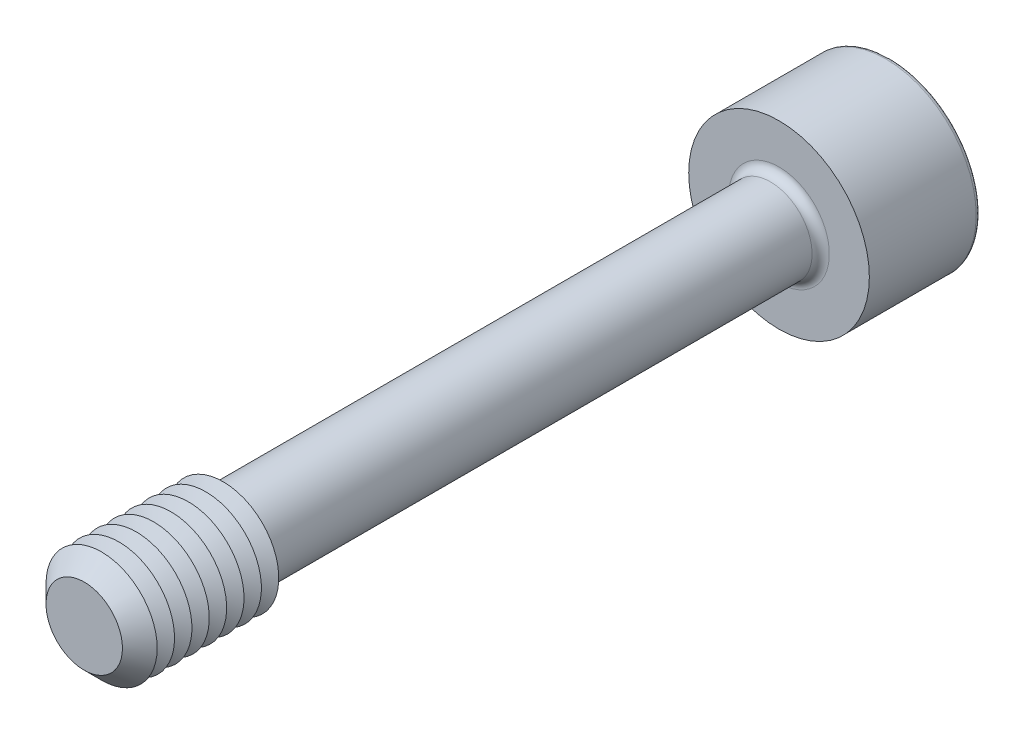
ISO-10303-21;
HEADER;
FILE_DESCRIPTION(('STEP AP214'),'2;1');
FILE_NAME('part.step','',(''),(''),'','','');
FILE_SCHEMA(('AUTOMOTIVE_DESIGN { 1 0 10303 214 1 1 1 1 }'));
ENDSEC;
DATA;
#1=APPLICATION_CONTEXT('core data for automotive mechanical design processes');
#2=APPLICATION_PROTOCOL_DEFINITION('international standard','automotive_design',2000,#1);
#3=PRODUCT_CONTEXT('',#1,'mechanical');
#4=PRODUCT('Part','Part','',(#3));
#5=PRODUCT_RELATED_PRODUCT_CATEGORY('part','',(#4));
#6=PRODUCT_DEFINITION_FORMATION('','',#4);
#7=PRODUCT_DEFINITION_CONTEXT('part definition',#1,'design');
#8=PRODUCT_DEFINITION('design','',#6,#7);
#9=PRODUCT_DEFINITION_SHAPE('','',#8);
#10=(LENGTH_UNIT() NAMED_UNIT(*) SI_UNIT(.MILLI.,.METRE.));
#11=(NAMED_UNIT(*) PLANE_ANGLE_UNIT() SI_UNIT($,.RADIAN.));
#12=(NAMED_UNIT(*) SI_UNIT($,.STERADIAN.) SOLID_ANGLE_UNIT());
#13=UNCERTAINTY_MEASURE_WITH_UNIT(LENGTH_MEASURE(1.E-05),#10,'distance_accuracy_value','');
#14=(GEOMETRIC_REPRESENTATION_CONTEXT(3) GLOBAL_UNCERTAINTY_ASSIGNED_CONTEXT((#13)) GLOBAL_UNIT_ASSIGNED_CONTEXT((#10,
#11,#12)) REPRESENTATION_CONTEXT('',''));
#15=CARTESIAN_POINT('',(0.,0.,0.));
#16=DIRECTION('',(0.,0.,1.));
#17=DIRECTION('',(1.,0.,0.));
#18=AXIS2_PLACEMENT_3D('',#15,#16,#17);
#19=CARTESIAN_POINT('',(-1.73205080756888,-3.,-27.));
#20=DIRECTION('',(0.,0.,1.));
#21=DIRECTION('',(1.,0.,0.));
#22=AXIS2_PLACEMENT_3D('',#19,#20,#21);
#23=PLANE('',#22);
#24=DIRECTION('',(1.,0.,0.));
#25=VECTOR('',#24,1.);
#26=CARTESIAN_POINT('',(-1.73205080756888,-3.,-27.));
#27=LINE('',#26,#25);
#28=CARTESIAN_POINT('',(0.,-3.,-27.));
#29=VERTEX_POINT('',#28);
#30=CARTESIAN_POINT('',(1.73205080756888,-3.,-27.));
#31=VERTEX_POINT('',#30);
#32=EDGE_CURVE('E404',#29,#31,#27,.T.);
#33=ORIENTED_EDGE('',*,*,#32,.F.);
#34=CARTESIAN_POINT('',(0.,0.,-27.));
#35=DIRECTION('',(0.,0.,1.));
#36=DIRECTION('',(0.,-1.,0.));
#37=AXIS2_PLACEMENT_3D('',#34,#35,#36);
#38=CIRCLE('',#37,3.);
#39=CARTESIAN_POINT('',(2.59807621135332,-1.5,-27.));
#40=VERTEX_POINT('',#39);
#41=EDGE_CURVE('E53',#29,#40,#38,.T.);
#42=ORIENTED_EDGE('',*,*,#41,.T.);
#43=DIRECTION('',(0.5,0.866025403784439,0.));
#44=VECTOR('',#43,1.);
#45=CARTESIAN_POINT('',(1.73205080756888,-3.,-27.));
#46=LINE('',#45,#44);
#47=EDGE_CURVE('E392',#31,#40,#46,.T.);
#48=ORIENTED_EDGE('',*,*,#47,.F.);
#49=EDGE_LOOP('',(#33,#42,#48));
#50=FACE_BOUND('',#49,.T.);
#51=ADVANCED_FACE('F41',(#50),#23,.F.);
#52=CARTESIAN_POINT('',(3.46410161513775,0.,-27.));
#53=VERTEX_POINT('',#52);
#54=EDGE_CURVE('E398',#40,#53,#46,.T.);
#55=ORIENTED_EDGE('',*,*,#54,.F.);
#56=CARTESIAN_POINT('',(2.59807621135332,1.5,-27.));
#57=VERTEX_POINT('',#56);
#58=EDGE_CURVE('E11',#40,#57,#38,.T.);
#59=ORIENTED_EDGE('',*,*,#58,.T.);
#60=DIRECTION('',(-0.5,0.866025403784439,0.));
#61=VECTOR('',#60,1.);
#62=CARTESIAN_POINT('',(3.46410161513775,0.,-27.));
#63=LINE('',#62,#61);
#64=EDGE_CURVE('E388',#53,#57,#63,.T.);
#65=ORIENTED_EDGE('',*,*,#64,.F.);
#66=EDGE_LOOP('',(#55,#59,#65));
#67=FACE_BOUND('',#66,.T.);
#68=ADVANCED_FACE('F133',(#67),#23,.F.);
#69=CARTESIAN_POINT('',(1.73205080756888,3.,-27.));
#70=VERTEX_POINT('',#69);
#71=EDGE_CURVE('E387',#57,#70,#63,.T.);
#72=ORIENTED_EDGE('',*,*,#71,.F.);
#73=CARTESIAN_POINT('',(0.,3.,-27.));
#74=VERTEX_POINT('',#73);
#75=EDGE_CURVE('E51',#57,#74,#38,.T.);
#76=ORIENTED_EDGE('',*,*,#75,.T.);
#77=DIRECTION('',(-1.,0.,0.));
#78=VECTOR('',#77,1.);
#79=CARTESIAN_POINT('',(1.73205080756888,3.,-27.));
#80=LINE('',#79,#78);
#81=EDGE_CURVE('E177',#70,#74,#80,.T.);
#82=ORIENTED_EDGE('',*,*,#81,.F.);
#83=EDGE_LOOP('',(#72,#76,#82));
#84=FACE_BOUND('',#83,.T.);
#85=ADVANCED_FACE('F139',(#84),#23,.F.);
#86=CARTESIAN_POINT('',(-1.73205080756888,3.,-27.));
#87=VERTEX_POINT('',#86);
#88=EDGE_CURVE('E395',#74,#87,#80,.T.);
#89=ORIENTED_EDGE('',*,*,#88,.F.);
#90=CARTESIAN_POINT('',(-2.59807621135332,1.5,-27.));
#91=VERTEX_POINT('',#90);
#92=EDGE_CURVE('E264',#74,#91,#38,.T.);
#93=ORIENTED_EDGE('',*,*,#92,.T.);
#94=DIRECTION('',(-0.5,-0.866025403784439,0.));
#95=VECTOR('',#94,1.);
#96=CARTESIAN_POINT('',(-1.73205080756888,3.,-27.));
#97=LINE('',#96,#95);
#98=EDGE_CURVE('E176',#87,#91,#97,.T.);
#99=ORIENTED_EDGE('',*,*,#98,.F.);
#100=EDGE_LOOP('',(#89,#93,#99));
#101=FACE_BOUND('',#100,.T.);
#102=ADVANCED_FACE('F157',(#101),#23,.F.);
#103=CARTESIAN_POINT('',(-3.46410161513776,0.,-27.));
#104=VERTEX_POINT('',#103);
#105=EDGE_CURVE('E170',#91,#104,#97,.T.);
#106=ORIENTED_EDGE('',*,*,#105,.F.);
#107=CARTESIAN_POINT('',(-2.59807621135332,-1.5,-27.));
#108=VERTEX_POINT('',#107);
#109=EDGE_CURVE('E172',#91,#108,#38,.T.);
#110=ORIENTED_EDGE('',*,*,#109,.T.);
#111=DIRECTION('',(0.5,-0.866025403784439,0.));
#112=VECTOR('',#111,1.);
#113=CARTESIAN_POINT('',(-3.46410161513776,0.,-27.));
#114=LINE('',#113,#112);
#115=EDGE_CURVE('E174',#104,#108,#114,.T.);
#116=ORIENTED_EDGE('',*,*,#115,.F.);
#117=EDGE_LOOP('',(#106,#110,#116));
#118=FACE_BOUND('',#117,.T.);
#119=ADVANCED_FACE('F146',(#118),#23,.F.);
#120=CARTESIAN_POINT('',(0.,0.,-33.));
#121=DIRECTION('',(0.,0.,-1.));
#122=DIRECTION('',(-1.,0.,0.));
#123=AXIS2_PLACEMENT_3D('',#120,#121,#122);
#124=PLANE('',#123);
#125=CARTESIAN_POINT('',(0.,0.,-33.));
#126=DIRECTION('',(0.,0.,-1.));
#127=DIRECTION('',(-1.,0.,0.));
#128=AXIS2_PLACEMENT_3D('',#125,#126,#127);
#129=CIRCLE('',#128,6.19);
#130=CARTESIAN_POINT('',(-6.19,0.,-33.));
#131=VERTEX_POINT('',#130);
#132=EDGE_CURVE('E248',#131,#131,#129,.T.);
#133=ORIENTED_EDGE('',*,*,#132,.T.);
#134=EDGE_LOOP('',(#133));
#135=FACE_BOUND('',#134,.T.);
#136=DIRECTION('',(-0.5,-0.866025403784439,0.));
#137=VECTOR('',#136,1.);
#138=CARTESIAN_POINT('',(-1.73205080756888,3.,-33.));
#139=LINE('',#138,#137);
#140=CARTESIAN_POINT('',(-1.73205080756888,3.,-33.));
#141=VERTEX_POINT('',#140);
#142=CARTESIAN_POINT('',(-3.46410161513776,0.,-33.));
#143=VERTEX_POINT('',#142);
#144=EDGE_CURVE('E211',#141,#143,#139,.T.);
#145=ORIENTED_EDGE('',*,*,#144,.T.);
#146=DIRECTION('',(0.5,-0.866025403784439,0.));
#147=VECTOR('',#146,1.);
#148=CARTESIAN_POINT('',(-3.46410161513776,0.,-33.));
#149=LINE('',#148,#147);
#150=CARTESIAN_POINT('',(-1.73205080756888,-3.,-33.));
#151=VERTEX_POINT('',#150);
#152=EDGE_CURVE('E67',#143,#151,#149,.T.);
#153=ORIENTED_EDGE('',*,*,#152,.T.);
#154=DIRECTION('',(1.,0.,0.));
#155=VECTOR('',#154,1.);
#156=CARTESIAN_POINT('',(-1.73205080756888,-3.,-33.));
#157=LINE('',#156,#155);
#158=CARTESIAN_POINT('',(1.73205080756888,-3.,-33.));
#159=VERTEX_POINT('',#158);
#160=EDGE_CURVE('E195',#151,#159,#157,.T.);
#161=ORIENTED_EDGE('',*,*,#160,.T.);
#162=DIRECTION('',(0.5,0.866025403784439,0.));
#163=VECTOR('',#162,1.);
#164=CARTESIAN_POINT('',(1.73205080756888,-3.,-33.));
#165=LINE('',#164,#163);
#166=CARTESIAN_POINT('',(3.46410161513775,0.,-33.));
#167=VERTEX_POINT('',#166);
#168=EDGE_CURVE('E199',#159,#167,#165,.T.);
#169=ORIENTED_EDGE('',*,*,#168,.T.);
#170=DIRECTION('',(-0.5,0.866025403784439,0.));
#171=VECTOR('',#170,1.);
#172=CARTESIAN_POINT('',(3.46410161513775,0.,-33.));
#173=LINE('',#172,#171);
#174=CARTESIAN_POINT('',(1.73205080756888,3.,-33.));
#175=VERTEX_POINT('',#174);
#176=EDGE_CURVE('E203',#167,#175,#173,.T.);
#177=ORIENTED_EDGE('',*,*,#176,.T.);
#178=DIRECTION('',(-1.,0.,0.));
#179=VECTOR('',#178,1.);
#180=CARTESIAN_POINT('',(1.73205080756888,3.,-33.));
#181=LINE('',#180,#179);
#182=EDGE_CURVE('E207',#175,#141,#181,.T.);
#183=ORIENTED_EDGE('',*,*,#182,.T.);
#184=EDGE_LOOP('',(#145,#153,#161,#169,#177,#183));
#185=FACE_BOUND('',#184,.T.);
#186=ADVANCED_FACE('F156',(#135,#185),#124,.T.);
#187=CARTESIAN_POINT('',(0.,0.,25.));
#188=DIRECTION('',(0.,0.,-1.));
#189=DIRECTION('',(-1.,0.,0.));
#190=AXIS2_PLACEMENT_3D('',#187,#188,#189);
#191=CYLINDRICAL_SURFACE('',#190,3.);
#192=CARTESIAN_POINT('',(0.,0.,-24.38));
#193=DIRECTION('',(0.,0.,-1.));
#194=DIRECTION('',(-1.,0.,0.));
#195=AXIS2_PLACEMENT_3D('',#192,#193,#194);
#196=CIRCLE('',#195,3.);
#197=CARTESIAN_POINT('',(-3.,0.,-24.38));
#198=VERTEX_POINT('',#197);
#199=EDGE_CURVE('E245',#198,#198,#196,.F.);
#200=ORIENTED_EDGE('',*,*,#199,.T.);
#201=EDGE_LOOP('',(#200));
#202=FACE_BOUND('',#201,.T.);
#203=CARTESIAN_POINT('',(0.,0.,14.4226497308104));
#204=DIRECTION('',(0.,0.,-1.));
#205=DIRECTION('',(0.,1.,0.));
#206=AXIS2_PLACEMENT_3D('',#203,#204,#205);
#207=CIRCLE('',#206,3.);
#208=CARTESIAN_POINT('',(0.,3.,14.4226497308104));
#209=VERTEX_POINT('',#208);
#210=EDGE_CURVE('E234',#209,#209,#207,.T.);
#211=ORIENTED_EDGE('',*,*,#210,.T.);
#212=EDGE_LOOP('',(#211));
#213=FACE_BOUND('',#212,.T.);
#214=ADVANCED_FACE('F163',(#202,#213),#191,.T.);
#215=CARTESIAN_POINT('',(0.,0.,14.4226497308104));
#216=DIRECTION('',(0.,0.,1.));
#217=DIRECTION('',(0.,-1.,0.));
#218=AXIS2_PLACEMENT_3D('',#215,#216,#217);
#219=CONICAL_SURFACE('',#218,3.,1.0471975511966);
#220=CARTESIAN_POINT('',(0.,0.,15.));
#221=DIRECTION('',(0.,0.,-1.));
#222=DIRECTION('',(-1.,0.,0.));
#223=AXIS2_PLACEMENT_3D('',#220,#221,#222);
#224=CIRCLE('',#223,4.);
#225=CARTESIAN_POINT('',(-4.,0.,15.));
#226=VERTEX_POINT('',#225);
#227=EDGE_CURVE('E268',#226,#226,#224,.T.);
#228=ORIENTED_EDGE('',*,*,#227,.T.);
#229=EDGE_LOOP('',(#228));
#230=FACE_BOUND('',#229,.T.);
#231=ORIENTED_EDGE('',*,*,#210,.F.);
#232=EDGE_LOOP('',(#231));
#233=FACE_BOUND('',#232,.T.);
#234=ADVANCED_FACE('F345',(#230,#233),#219,.T.);
#235=CARTESIAN_POINT('',(0.,0.,-25.));
#236=DIRECTION('',(0.,0.,-1.));
#237=DIRECTION('',(-1.,0.,0.));
#238=AXIS2_PLACEMENT_3D('',#235,#236,#237);
#239=PLANE('',#238);
#240=CARTESIAN_POINT('',(0.,0.,-25.));
#241=DIRECTION('',(0.,0.,-1.));
#242=DIRECTION('',(-1.,0.,0.));
#243=AXIS2_PLACEMENT_3D('',#240,#241,#242);
#244=CIRCLE('',#243,3.62);
#245=CARTESIAN_POINT('',(-3.62,0.,-25.));
#246=VERTEX_POINT('',#245);
#247=EDGE_CURVE('E241',#246,#246,#244,.T.);
#248=ORIENTED_EDGE('',*,*,#247,.T.);
#249=EDGE_LOOP('',(#248));
#250=FACE_BOUND('',#249,.T.);
#251=CARTESIAN_POINT('',(0.,0.,-25.));
#252=DIRECTION('',(0.,0.,-1.));
#253=DIRECTION('',(-1.,0.,0.));
#254=AXIS2_PLACEMENT_3D('',#251,#252,#253);
#255=CIRCLE('',#254,6.5);
#256=CARTESIAN_POINT('',(-6.5,0.,-25.));
#257=VERTEX_POINT('',#256);
#258=EDGE_CURVE('E230',#257,#257,#255,.T.);
#259=ORIENTED_EDGE('',*,*,#258,.F.);
#260=EDGE_LOOP('',(#259));
#261=FACE_BOUND('',#260,.T.);
#262=ADVANCED_FACE('F350',(#250,#261),#239,.F.);
#263=CARTESIAN_POINT('',(0.,0.,-33.));
#264=DIRECTION('',(0.,0.,1.));
#265=DIRECTION('',(1.,0.,0.));
#266=AXIS2_PLACEMENT_3D('',#263,#264,#265);
#267=CYLINDRICAL_SURFACE('',#266,6.5);
#268=CARTESIAN_POINT('',(0.,0.,-32.69));
#269=DIRECTION('',(0.,0.,-1.));
#270=DIRECTION('',(-1.,0.,0.));
#271=AXIS2_PLACEMENT_3D('',#268,#269,#270);
#272=CIRCLE('',#271,6.5);
#273=CARTESIAN_POINT('',(-6.5,0.,-32.69));
#274=VERTEX_POINT('',#273);
#275=EDGE_CURVE('E45',#274,#274,#272,.F.);
#276=ORIENTED_EDGE('',*,*,#275,.T.);
#277=EDGE_LOOP('',(#276));
#278=FACE_BOUND('',#277,.T.);
#279=ORIENTED_EDGE('',*,*,#258,.T.);
#280=EDGE_LOOP('',(#279));
#281=FACE_BOUND('',#280,.T.);
#282=ADVANCED_FACE('F351',(#278,#281),#267,.T.);
#283=CARTESIAN_POINT('',(-3.46410161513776,0.,-27.));
#284=DIRECTION('',(0.866025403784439,0.5,0.));
#285=DIRECTION('',(-0.5,0.866025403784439,0.));
#286=AXIS2_PLACEMENT_3D('',#283,#284,#285);
#287=PLANE('',#286);
#288=ORIENTED_EDGE('',*,*,#152,.F.);
#289=DIRECTION('',(0.,0.,-1.));
#290=VECTOR('',#289,1.);
#291=CARTESIAN_POINT('',(-3.46410161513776,0.,-27.));
#292=LINE('',#291,#290);
#293=EDGE_CURVE('E186',#104,#143,#292,.T.);
#294=ORIENTED_EDGE('',*,*,#293,.F.);
#295=ORIENTED_EDGE('',*,*,#115,.T.);
#296=CARTESIAN_POINT('',(-1.73205080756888,-3.,-27.));
#297=VERTEX_POINT('',#296);
#298=EDGE_CURVE('E214',#108,#297,#114,.T.);
#299=ORIENTED_EDGE('',*,*,#298,.T.);
#300=DIRECTION('',(0.,0.,-1.));
#301=VECTOR('',#300,1.);
#302=CARTESIAN_POINT('',(-1.73205080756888,-3.,-27.));
#303=LINE('',#302,#301);
#304=EDGE_CURVE('E227',#297,#151,#303,.T.);
#305=ORIENTED_EDGE('',*,*,#304,.T.);
#306=EDGE_LOOP('',(#288,#294,#295,#299,#305));
#307=FACE_BOUND('',#306,.T.);
#308=ADVANCED_FACE('F354',(#307),#287,.T.);
#309=CARTESIAN_POINT('',(-1.73205080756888,-3.,-27.));
#310=DIRECTION('',(0.,1.,0.));
#311=DIRECTION('',(0.,0.,1.));
#312=AXIS2_PLACEMENT_3D('',#309,#310,#311);
#313=PLANE('',#312);
#314=ORIENTED_EDGE('',*,*,#160,.F.);
#315=ORIENTED_EDGE('',*,*,#304,.F.);
#316=EDGE_CURVE('E401',#297,#29,#27,.T.);
#317=ORIENTED_EDGE('',*,*,#316,.T.);
#318=ORIENTED_EDGE('',*,*,#32,.T.);
#319=DIRECTION('',(0.,0.,-1.));
#320=VECTOR('',#319,1.);
#321=CARTESIAN_POINT('',(1.73205080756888,-3.,-27.));
#322=LINE('',#321,#320);
#323=EDGE_CURVE('E224',#31,#159,#322,.T.);
#324=ORIENTED_EDGE('',*,*,#323,.T.);
#325=EDGE_LOOP('',(#314,#315,#317,#318,#324));
#326=FACE_BOUND('',#325,.T.);
#327=ADVANCED_FACE('F360',(#326),#313,.T.);
#328=CARTESIAN_POINT('',(1.73205080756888,-3.,-27.));
#329=DIRECTION('',(-0.866025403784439,0.5,0.));
#330=DIRECTION('',(-0.5,-0.866025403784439,0.));
#331=AXIS2_PLACEMENT_3D('',#328,#329,#330);
#332=PLANE('',#331);
#333=ORIENTED_EDGE('',*,*,#168,.F.);
#334=ORIENTED_EDGE('',*,*,#323,.F.);
#335=ORIENTED_EDGE('',*,*,#47,.T.);
#336=ORIENTED_EDGE('',*,*,#54,.T.);
#337=DIRECTION('',(0.,0.,-1.));
#338=VECTOR('',#337,1.);
#339=CARTESIAN_POINT('',(3.46410161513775,0.,-27.));
#340=LINE('',#339,#338);
#341=EDGE_CURVE('E221',#53,#167,#340,.T.);
#342=ORIENTED_EDGE('',*,*,#341,.T.);
#343=EDGE_LOOP('',(#333,#334,#335,#336,#342));
#344=FACE_BOUND('',#343,.T.);
#345=ADVANCED_FACE('F363',(#344),#332,.T.);
#346=CARTESIAN_POINT('',(3.46410161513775,0.,-27.));
#347=DIRECTION('',(-0.866025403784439,-0.5,0.));
#348=DIRECTION('',(0.5,-0.866025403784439,0.));
#349=AXIS2_PLACEMENT_3D('',#346,#347,#348);
#350=PLANE('',#349);
#351=ORIENTED_EDGE('',*,*,#176,.F.);
#352=ORIENTED_EDGE('',*,*,#341,.F.);
#353=ORIENTED_EDGE('',*,*,#64,.T.);
#354=ORIENTED_EDGE('',*,*,#71,.T.);
#355=DIRECTION('',(0.,0.,-1.));
#356=VECTOR('',#355,1.);
#357=CARTESIAN_POINT('',(1.73205080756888,3.,-27.));
#358=LINE('',#357,#356);
#359=EDGE_CURVE('E218',#70,#175,#358,.T.);
#360=ORIENTED_EDGE('',*,*,#359,.T.);
#361=EDGE_LOOP('',(#351,#352,#353,#354,#360));
#362=FACE_BOUND('',#361,.T.);
#363=ADVANCED_FACE('F367',(#362),#350,.T.);
#364=CARTESIAN_POINT('',(1.73205080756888,3.,-27.));
#365=DIRECTION('',(0.,-1.,0.));
#366=DIRECTION('',(1.,0.,0.));
#367=AXIS2_PLACEMENT_3D('',#364,#365,#366);
#368=PLANE('',#367);
#369=ORIENTED_EDGE('',*,*,#182,.F.);
#370=ORIENTED_EDGE('',*,*,#359,.F.);
#371=ORIENTED_EDGE('',*,*,#81,.T.);
#372=ORIENTED_EDGE('',*,*,#88,.T.);
#373=DIRECTION('',(0.,0.,-1.));
#374=VECTOR('',#373,1.);
#375=CARTESIAN_POINT('',(-1.73205080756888,3.,-27.));
#376=LINE('',#375,#374);
#377=EDGE_CURVE('E182',#87,#141,#376,.T.);
#378=ORIENTED_EDGE('',*,*,#377,.T.);
#379=EDGE_LOOP('',(#369,#370,#371,#372,#378));
#380=FACE_BOUND('',#379,.T.);
#381=ADVANCED_FACE('F152',(#380),#368,.T.);
#382=CARTESIAN_POINT('',(-1.73205080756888,3.,-27.));
#383=DIRECTION('',(0.866025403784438,-0.5,0.));
#384=DIRECTION('',(0.5,0.866025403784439,0.));
#385=AXIS2_PLACEMENT_3D('',#382,#383,#384);
#386=PLANE('',#385);
#387=ORIENTED_EDGE('',*,*,#144,.F.);
#388=ORIENTED_EDGE('',*,*,#377,.F.);
#389=ORIENTED_EDGE('',*,*,#98,.T.);
#390=ORIENTED_EDGE('',*,*,#105,.T.);
#391=ORIENTED_EDGE('',*,*,#293,.T.);
#392=EDGE_LOOP('',(#387,#388,#389,#390,#391));
#393=FACE_BOUND('',#392,.T.);
#394=ADVANCED_FACE('F144',(#393),#386,.T.);
#395=ORIENTED_EDGE('',*,*,#298,.F.);
#396=EDGE_CURVE('E255',#108,#29,#38,.T.);
#397=ORIENTED_EDGE('',*,*,#396,.T.);
#398=ORIENTED_EDGE('',*,*,#316,.F.);
#399=EDGE_LOOP('',(#395,#397,#398));
#400=FACE_BOUND('',#399,.T.);
#401=ADVANCED_FACE('F135',(#400),#23,.F.);
#402=CARTESIAN_POINT('',(0.,0.,-24.38));
#403=DIRECTION('',(0.,0.,-1.));
#404=DIRECTION('',(-1.,0.,0.));
#405=AXIS2_PLACEMENT_3D('',#402,#403,#404);
#406=TOROIDAL_SURFACE('',#405,3.62,0.62);
#407=ORIENTED_EDGE('',*,*,#199,.F.);
#408=EDGE_LOOP('',(#407));
#409=FACE_BOUND('',#408,.T.);
#410=ORIENTED_EDGE('',*,*,#247,.F.);
#411=EDGE_LOOP('',(#410));
#412=FACE_BOUND('',#411,.T.);
#413=ADVANCED_FACE('F129',(#409,#412),#406,.F.);
#414=CARTESIAN_POINT('',(0.,0.,-32.69));
#415=DIRECTION('',(0.,0.,-1.));
#416=DIRECTION('',(-1.,0.,0.));
#417=AXIS2_PLACEMENT_3D('',#414,#415,#416);
#418=TOROIDAL_SURFACE('',#417,6.19,0.31);
#419=ORIENTED_EDGE('',*,*,#275,.F.);
#420=EDGE_LOOP('',(#419));
#421=FACE_BOUND('',#420,.T.);
#422=ORIENTED_EDGE('',*,*,#132,.F.);
#423=EDGE_LOOP('',(#422));
#424=FACE_BOUND('',#423,.T.);
#425=ADVANCED_FACE('F43',(#421,#424),#418,.T.);
#426=CARTESIAN_POINT('',(0.,0.,-25.2679491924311));
#427=DIRECTION('',(0.,0.,-1.));
#428=DIRECTION('',(0.,1.,0.));
#429=AXIS2_PLACEMENT_3D('',#426,#427,#428);
#430=CONICAL_SURFACE('',#429,0.,1.0471975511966);
#431=ORIENTED_EDGE('',*,*,#41,.F.);
#432=ORIENTED_EDGE('',*,*,#396,.F.);
#433=ORIENTED_EDGE('',*,*,#109,.F.);
#434=ORIENTED_EDGE('',*,*,#92,.F.);
#435=ORIENTED_EDGE('',*,*,#75,.F.);
#436=ORIENTED_EDGE('',*,*,#58,.F.);
#437=EDGE_LOOP('',(#431,#432,#433,#434,#435,#436));
#438=FACE_BOUND('',#437,.T.);
#439=CARTESIAN_POINT('',(0.,0.,-25.2679491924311));
#440=VERTEX_POINT('',#439);
#441=VERTEX_LOOP('',#440);
#442=FACE_BOUND('',#441,.T.);
#443=ADVANCED_FACE('F118',(#438,#442),#430,.F.);
#444=CARTESIAN_POINT('',(0.,0.,15.625));
#445=DIRECTION('',(0.,0.,-1.));
#446=DIRECTION('',(-1.,0.,0.));
#447=AXIS2_PLACEMENT_3D('',#444,#445,#446);
#448=CONICAL_SURFACE('',#447,2.91746824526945,1.0471975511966);
#449=ORIENTED_EDGE('',*,*,#227,.F.);
#450=EDGE_LOOP('',(#449));
#451=FACE_BOUND('',#450,.T.);
#452=CARTESIAN_POINT('',(0.,0.,15.625));
#453=DIRECTION('',(0.,0.,-1.));
#454=DIRECTION('',(-1.,0.,0.));
#455=AXIS2_PLACEMENT_3D('',#452,#453,#454);
#456=CIRCLE('',#455,2.91746824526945);
#457=CARTESIAN_POINT('',(-2.91746824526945,0.,15.625));
#458=VERTEX_POINT('',#457);
#459=EDGE_CURVE('E272',#458,#458,#456,.T.);
#460=ORIENTED_EDGE('',*,*,#459,.T.);
#461=EDGE_LOOP('',(#460));
#462=FACE_BOUND('',#461,.T.);
#463=ADVANCED_FACE('F120',(#451,#462),#448,.T.);
#464=CARTESIAN_POINT('',(0.,0.,16.25));
#465=DIRECTION('',(0.,0.,1.));
#466=DIRECTION('',(1.,0.,0.));
#467=AXIS2_PLACEMENT_3D('',#464,#465,#466);
#468=CONICAL_SURFACE('',#467,4.,1.0471975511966);
#469=ORIENTED_EDGE('',*,*,#459,.F.);
#470=EDGE_LOOP('',(#469));
#471=FACE_BOUND('',#470,.T.);
#472=CARTESIAN_POINT('',(0.,0.,16.25));
#473=DIRECTION('',(0.,0.,-1.));
#474=DIRECTION('',(-1.,0.,0.));
#475=AXIS2_PLACEMENT_3D('',#472,#473,#474);
#476=CIRCLE('',#475,4.);
#477=CARTESIAN_POINT('',(-4.,0.,16.25));
#478=VERTEX_POINT('',#477);
#479=EDGE_CURVE('E278',#478,#478,#476,.T.);
#480=ORIENTED_EDGE('',*,*,#479,.T.);
#481=EDGE_LOOP('',(#480));
#482=FACE_BOUND('',#481,.T.);
#483=ADVANCED_FACE('F126',(#471,#482),#468,.T.);
#484=CARTESIAN_POINT('',(0.,0.,16.875));
#485=DIRECTION('',(0.,0.,-1.));
#486=DIRECTION('',(-1.,0.,0.));
#487=AXIS2_PLACEMENT_3D('',#484,#485,#486);
#488=CONICAL_SURFACE('',#487,2.91746824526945,1.0471975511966);
#489=ORIENTED_EDGE('',*,*,#479,.F.);
#490=EDGE_LOOP('',(#489));
#491=FACE_BOUND('',#490,.T.);
#492=CARTESIAN_POINT('',(0.,0.,16.875));
#493=DIRECTION('',(0.,0.,-1.));
#494=DIRECTION('',(-1.,0.,0.));
#495=AXIS2_PLACEMENT_3D('',#492,#493,#494);
#496=CIRCLE('',#495,2.91746824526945);
#497=CARTESIAN_POINT('',(-2.91746824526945,0.,16.875));
#498=VERTEX_POINT('',#497);
#499=EDGE_CURVE('E284',#498,#498,#496,.T.);
#500=ORIENTED_EDGE('',*,*,#499,.T.);
#501=EDGE_LOOP('',(#500));
#502=FACE_BOUND('',#501,.T.);
#503=ADVANCED_FACE('F508',(#491,#502),#488,.T.);
#504=CARTESIAN_POINT('',(0.,0.,17.5));
#505=DIRECTION('',(0.,0.,1.));
#506=DIRECTION('',(1.,0.,0.));
#507=AXIS2_PLACEMENT_3D('',#504,#505,#506);
#508=CONICAL_SURFACE('',#507,4.,1.0471975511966);
#509=ORIENTED_EDGE('',*,*,#499,.F.);
#510=EDGE_LOOP('',(#509));
#511=FACE_BOUND('',#510,.T.);
#512=CARTESIAN_POINT('',(0.,0.,17.5));
#513=DIRECTION('',(0.,0.,-1.));
#514=DIRECTION('',(-1.,0.,0.));
#515=AXIS2_PLACEMENT_3D('',#512,#513,#514);
#516=CIRCLE('',#515,4.);
#517=CARTESIAN_POINT('',(-4.,0.,17.5));
#518=VERTEX_POINT('',#517);
#519=EDGE_CURVE('E288',#518,#518,#516,.T.);
#520=ORIENTED_EDGE('',*,*,#519,.T.);
#521=EDGE_LOOP('',(#520));
#522=FACE_BOUND('',#521,.T.);
#523=ADVANCED_FACE('F517',(#511,#522),#508,.T.);
#524=CARTESIAN_POINT('',(0.,0.,18.125));
#525=DIRECTION('',(0.,0.,-1.));
#526=DIRECTION('',(-1.,0.,0.));
#527=AXIS2_PLACEMENT_3D('',#524,#525,#526);
#528=CONICAL_SURFACE('',#527,2.91746824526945,1.0471975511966);
#529=ORIENTED_EDGE('',*,*,#519,.F.);
#530=EDGE_LOOP('',(#529));
#531=FACE_BOUND('',#530,.T.);
#532=CARTESIAN_POINT('',(0.,0.,18.125));
#533=DIRECTION('',(0.,0.,-1.));
#534=DIRECTION('',(-1.,0.,0.));
#535=AXIS2_PLACEMENT_3D('',#532,#533,#534);
#536=CIRCLE('',#535,2.91746824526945);
#537=CARTESIAN_POINT('',(-2.91746824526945,0.,18.125));
#538=VERTEX_POINT('',#537);
#539=EDGE_CURVE('E292',#538,#538,#536,.T.);
#540=ORIENTED_EDGE('',*,*,#539,.T.);
#541=EDGE_LOOP('',(#540));
#542=FACE_BOUND('',#541,.T.);
#543=ADVANCED_FACE('F526',(#531,#542),#528,.T.);
#544=CARTESIAN_POINT('',(0.,0.,18.75));
#545=DIRECTION('',(0.,0.,1.));
#546=DIRECTION('',(1.,0.,0.));
#547=AXIS2_PLACEMENT_3D('',#544,#545,#546);
#548=CONICAL_SURFACE('',#547,4.,1.0471975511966);
#549=ORIENTED_EDGE('',*,*,#539,.F.);
#550=EDGE_LOOP('',(#549));
#551=FACE_BOUND('',#550,.T.);
#552=CARTESIAN_POINT('',(0.,0.,18.75));
#553=DIRECTION('',(0.,0.,-1.));
#554=DIRECTION('',(-1.,0.,0.));
#555=AXIS2_PLACEMENT_3D('',#552,#553,#554);
#556=CIRCLE('',#555,4.);
#557=CARTESIAN_POINT('',(-4.,0.,18.75));
#558=VERTEX_POINT('',#557);
#559=EDGE_CURVE('E296',#558,#558,#556,.T.);
#560=ORIENTED_EDGE('',*,*,#559,.T.);
#561=EDGE_LOOP('',(#560));
#562=FACE_BOUND('',#561,.T.);
#563=ADVANCED_FACE('F535',(#551,#562),#548,.T.);
#564=CARTESIAN_POINT('',(0.,0.,19.375));
#565=DIRECTION('',(0.,0.,-1.));
#566=DIRECTION('',(-1.,0.,0.));
#567=AXIS2_PLACEMENT_3D('',#564,#565,#566);
#568=CONICAL_SURFACE('',#567,2.91746824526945,1.0471975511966);
#569=ORIENTED_EDGE('',*,*,#559,.F.);
#570=EDGE_LOOP('',(#569));
#571=FACE_BOUND('',#570,.T.);
#572=CARTESIAN_POINT('',(0.,0.,19.375));
#573=DIRECTION('',(0.,0.,-1.));
#574=DIRECTION('',(-1.,0.,0.));
#575=AXIS2_PLACEMENT_3D('',#572,#573,#574);
#576=CIRCLE('',#575,2.91746824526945);
#577=CARTESIAN_POINT('',(-2.91746824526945,0.,19.375));
#578=VERTEX_POINT('',#577);
#579=EDGE_CURVE('E300',#578,#578,#576,.T.);
#580=ORIENTED_EDGE('',*,*,#579,.T.);
#581=EDGE_LOOP('',(#580));
#582=FACE_BOUND('',#581,.T.);
#583=ADVANCED_FACE('F544',(#571,#582),#568,.T.);
#584=CARTESIAN_POINT('',(0.,0.,20.));
#585=DIRECTION('',(0.,0.,1.));
#586=DIRECTION('',(1.,0.,0.));
#587=AXIS2_PLACEMENT_3D('',#584,#585,#586);
#588=CONICAL_SURFACE('',#587,4.,1.0471975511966);
#589=ORIENTED_EDGE('',*,*,#579,.F.);
#590=EDGE_LOOP('',(#589));
#591=FACE_BOUND('',#590,.T.);
#592=CARTESIAN_POINT('',(0.,0.,20.));
#593=DIRECTION('',(0.,0.,-1.));
#594=DIRECTION('',(-1.,0.,0.));
#595=AXIS2_PLACEMENT_3D('',#592,#593,#594);
#596=CIRCLE('',#595,4.);
#597=CARTESIAN_POINT('',(-4.,0.,20.));
#598=VERTEX_POINT('',#597);
#599=EDGE_CURVE('E304',#598,#598,#596,.T.);
#600=ORIENTED_EDGE('',*,*,#599,.T.);
#601=EDGE_LOOP('',(#600));
#602=FACE_BOUND('',#601,.T.);
#603=ADVANCED_FACE('F553',(#591,#602),#588,.T.);
#604=CARTESIAN_POINT('',(0.,0.,20.625));
#605=DIRECTION('',(0.,0.,-1.));
#606=DIRECTION('',(-1.,0.,0.));
#607=AXIS2_PLACEMENT_3D('',#604,#605,#606);
#608=CONICAL_SURFACE('',#607,2.91746824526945,1.0471975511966);
#609=ORIENTED_EDGE('',*,*,#599,.F.);
#610=EDGE_LOOP('',(#609));
#611=FACE_BOUND('',#610,.T.);
#612=CARTESIAN_POINT('',(0.,0.,20.625));
#613=DIRECTION('',(0.,0.,-1.));
#614=DIRECTION('',(-1.,0.,0.));
#615=AXIS2_PLACEMENT_3D('',#612,#613,#614);
#616=CIRCLE('',#615,2.91746824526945);
#617=CARTESIAN_POINT('',(-2.91746824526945,0.,20.625));
#618=VERTEX_POINT('',#617);
#619=EDGE_CURVE('E307',#618,#618,#616,.T.);
#620=ORIENTED_EDGE('',*,*,#619,.T.);
#621=EDGE_LOOP('',(#620));
#622=FACE_BOUND('',#621,.T.);
#623=ADVANCED_FACE('F562',(#611,#622),#608,.T.);
#624=CARTESIAN_POINT('',(0.,0.,21.25));
#625=DIRECTION('',(0.,0.,1.));
#626=DIRECTION('',(1.,0.,0.));
#627=AXIS2_PLACEMENT_3D('',#624,#625,#626);
#628=CONICAL_SURFACE('',#627,4.,1.0471975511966);
#629=ORIENTED_EDGE('',*,*,#619,.F.);
#630=EDGE_LOOP('',(#629));
#631=FACE_BOUND('',#630,.T.);
#632=CARTESIAN_POINT('',(0.,0.,21.25));
#633=DIRECTION('',(0.,0.,-1.));
#634=DIRECTION('',(-1.,0.,0.));
#635=AXIS2_PLACEMENT_3D('',#632,#633,#634);
#636=CIRCLE('',#635,4.);
#637=CARTESIAN_POINT('',(-4.,0.,21.25));
#638=VERTEX_POINT('',#637);
#639=EDGE_CURVE('E311',#638,#638,#636,.T.);
#640=ORIENTED_EDGE('',*,*,#639,.T.);
#641=EDGE_LOOP('',(#640));
#642=FACE_BOUND('',#641,.T.);
#643=ADVANCED_FACE('F571',(#631,#642),#628,.T.);
#644=CARTESIAN_POINT('',(0.,0.,21.875));
#645=DIRECTION('',(0.,0.,-1.));
#646=DIRECTION('',(-1.,0.,0.));
#647=AXIS2_PLACEMENT_3D('',#644,#645,#646);
#648=CONICAL_SURFACE('',#647,2.91746824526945,1.0471975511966);
#649=ORIENTED_EDGE('',*,*,#639,.F.);
#650=EDGE_LOOP('',(#649));
#651=FACE_BOUND('',#650,.T.);
#652=CARTESIAN_POINT('',(0.,0.,21.875));
#653=DIRECTION('',(0.,0.,-1.));
#654=DIRECTION('',(-1.,0.,0.));
#655=AXIS2_PLACEMENT_3D('',#652,#653,#654);
#656=CIRCLE('',#655,2.91746824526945);
#657=CARTESIAN_POINT('',(-2.91746824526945,0.,21.875));
#658=VERTEX_POINT('',#657);
#659=EDGE_CURVE('E315',#658,#658,#656,.T.);
#660=ORIENTED_EDGE('',*,*,#659,.T.);
#661=EDGE_LOOP('',(#660));
#662=FACE_BOUND('',#661,.T.);
#663=ADVANCED_FACE('F580',(#651,#662),#648,.T.);
#664=CARTESIAN_POINT('',(0.,0.,22.5));
#665=DIRECTION('',(0.,0.,1.));
#666=DIRECTION('',(1.,0.,0.));
#667=AXIS2_PLACEMENT_3D('',#664,#665,#666);
#668=CONICAL_SURFACE('',#667,4.,1.0471975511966);
#669=ORIENTED_EDGE('',*,*,#659,.F.);
#670=EDGE_LOOP('',(#669));
#671=FACE_BOUND('',#670,.T.);
#672=CARTESIAN_POINT('',(0.,0.,22.5));
#673=DIRECTION('',(0.,0.,-1.));
#674=DIRECTION('',(-1.,0.,0.));
#675=AXIS2_PLACEMENT_3D('',#672,#673,#674);
#676=CIRCLE('',#675,4.);
#677=CARTESIAN_POINT('',(-4.,0.,22.5));
#678=VERTEX_POINT('',#677);
#679=EDGE_CURVE('E319',#678,#678,#676,.T.);
#680=ORIENTED_EDGE('',*,*,#679,.T.);
#681=EDGE_LOOP('',(#680));
#682=FACE_BOUND('',#681,.T.);
#683=ADVANCED_FACE('F589',(#671,#682),#668,.T.);
#684=CARTESIAN_POINT('',(0.,0.,23.125));
#685=DIRECTION('',(0.,0.,-1.));
#686=DIRECTION('',(-1.,0.,0.));
#687=AXIS2_PLACEMENT_3D('',#684,#685,#686);
#688=CONICAL_SURFACE('',#687,2.91746824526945,1.0471975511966);
#689=ORIENTED_EDGE('',*,*,#679,.F.);
#690=EDGE_LOOP('',(#689));
#691=FACE_BOUND('',#690,.T.);
#692=CARTESIAN_POINT('',(0.,0.,23.125));
#693=DIRECTION('',(0.,0.,-1.));
#694=DIRECTION('',(-1.,0.,0.));
#695=AXIS2_PLACEMENT_3D('',#692,#693,#694);
#696=CIRCLE('',#695,2.91746824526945);
#697=CARTESIAN_POINT('',(-2.91746824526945,0.,23.125));
#698=VERTEX_POINT('',#697);
#699=EDGE_CURVE('E322',#698,#698,#696,.T.);
#700=ORIENTED_EDGE('',*,*,#699,.T.);
#701=EDGE_LOOP('',(#700));
#702=FACE_BOUND('',#701,.T.);
#703=ADVANCED_FACE('F598',(#691,#702),#688,.T.);
#704=CARTESIAN_POINT('',(0.,0.,23.75));
#705=DIRECTION('',(0.,0.,1.));
#706=DIRECTION('',(1.,0.,0.));
#707=AXIS2_PLACEMENT_3D('',#704,#705,#706);
#708=CONICAL_SURFACE('',#707,4.,1.0471975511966);
#709=ORIENTED_EDGE('',*,*,#699,.F.);
#710=EDGE_LOOP('',(#709));
#711=FACE_BOUND('',#710,.T.);
#712=CARTESIAN_POINT('',(0.,0.,23.75));
#713=DIRECTION('',(0.,0.,-1.));
#714=DIRECTION('',(-1.,0.,0.));
#715=AXIS2_PLACEMENT_3D('',#712,#713,#714);
#716=CIRCLE('',#715,4.);
#717=CARTESIAN_POINT('',(-4.,0.,23.75));
#718=VERTEX_POINT('',#717);
#719=EDGE_CURVE('E325',#718,#718,#716,.T.);
#720=ORIENTED_EDGE('',*,*,#719,.T.);
#721=EDGE_LOOP('',(#720));
#722=FACE_BOUND('',#721,.T.);
#723=ADVANCED_FACE('F330',(#711,#722),#708,.T.);
#724=CARTESIAN_POINT('',(0.,0.,25.));
#725=DIRECTION('',(0.,0.,1.));
#726=DIRECTION('',(1.,0.,0.));
#727=AXIS2_PLACEMENT_3D('',#724,#725,#726);
#728=PLANE('',#727);
#729=CARTESIAN_POINT('',(0.,0.,25.));
#730=DIRECTION('',(0.,0.,1.));
#731=DIRECTION('',(1.,0.,0.));
#732=AXIS2_PLACEMENT_3D('',#729,#730,#731);
#733=CIRCLE('',#732,2.74999999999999);
#734=CARTESIAN_POINT('',(2.74999999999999,0.,25.));
#735=VERTEX_POINT('',#734);
#736=EDGE_CURVE('E237',#735,#735,#733,.T.);
#737=ORIENTED_EDGE('',*,*,#736,.T.);
#738=EDGE_LOOP('',(#737));
#739=FACE_BOUND('',#738,.T.);
#740=ADVANCED_FACE('F334',(#739),#728,.T.);
#741=CARTESIAN_POINT('',(0.,0.,23.75));
#742=DIRECTION('',(0.,0.,-1.));
#743=DIRECTION('',(0.,1.,0.));
#744=AXIS2_PLACEMENT_3D('',#741,#742,#743);
#745=CONICAL_SURFACE('',#744,4.,0.785398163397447);
#746=ORIENTED_EDGE('',*,*,#736,.F.);
#747=EDGE_LOOP('',(#746));
#748=FACE_BOUND('',#747,.T.);
#749=ORIENTED_EDGE('',*,*,#719,.F.);
#750=EDGE_LOOP('',(#749));
#751=FACE_BOUND('',#750,.T.);
#752=ADVANCED_FACE('F332',(#748,#751),#745,.T.);
#753=CLOSED_SHELL('',(#51,#68,#85,#102,#119,#186,#214,#234,#262,#282,#308,#327,#345,#363,#381,
#394,#401,#413,#425,#443,#463,#483,#503,#523,#543,#563,#583,#603,#623,#643,#663,#683,#703,#723,
#740,#752));
#754=MANIFOLD_SOLID_BREP('B2',#753);
#755=ADVANCED_BREP_SHAPE_REPRESENTATION('',(#18,#754),#14);
#756=SHAPE_DEFINITION_REPRESENTATION(#9,#755);
ENDSEC;
END-ISO-10303-21;
